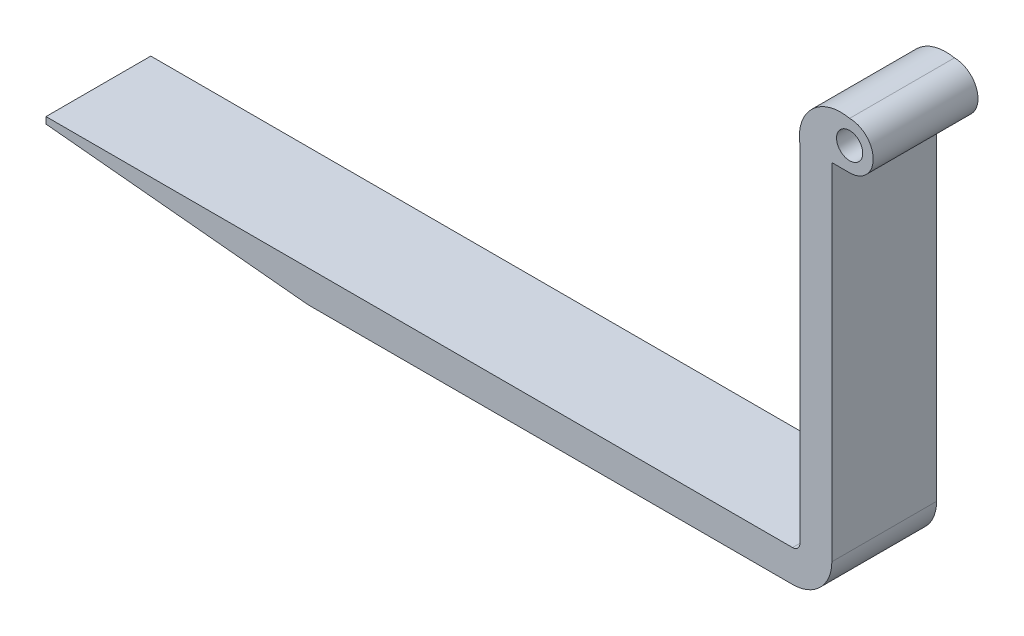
from build123d import *

# Parameters (mm, degrees)
BOSS_EXTRUDE1_DEPTH = 200
SKETCH3_R           = 25
BOSS_EXTRUDE2_DEPTH = 200


with BuildPart() as part:
    # Sketch2 → Boss-Extrude1 (new body)
    with BuildSketch(Plane.XY):
        with BuildLine():
            Line((0, 0), (0, -660))
            ThreePointArc((0, -660), (-21.966991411, -713.033008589), (-75, -735))
            Line((-75, -735), (-1000, -735))
            Line((-1000, -735), (-1500, -686.5))
            Line((-1500, -686.5), (-1500, -674))
            Line((-1500, -674), (-75, -674))
            ThreePointArc((-75, -674), (-65.100505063, -669.899494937), (-61, -660))
            Line((-61, -660), (-61, 0))
            Line((-61, 0), (0, 0))
        make_face()
    extrude(amount=-BOSS_EXTRUDE1_DEPTH)

    # Sketch3 → Boss-Extrude2 (add, through all)
    with BuildSketch(Plane.XY):
        with BuildLine():
            Line((0, 0), (34, 0))
            ThreePointArc((34, 0), (79, 45), (34, 90))
            ThreePointArc((34, 90), (-37.209500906, 70.0266954), (-61, 0))
            Line((-61, 0), (0, 0))
        make_face()
        with Locations((34, 45)):
            Circle(SKETCH3_R, mode=Mode.SUBTRACT)
    extrude(amount=-BOSS_EXTRUDE2_DEPTH)


solid = part.part
